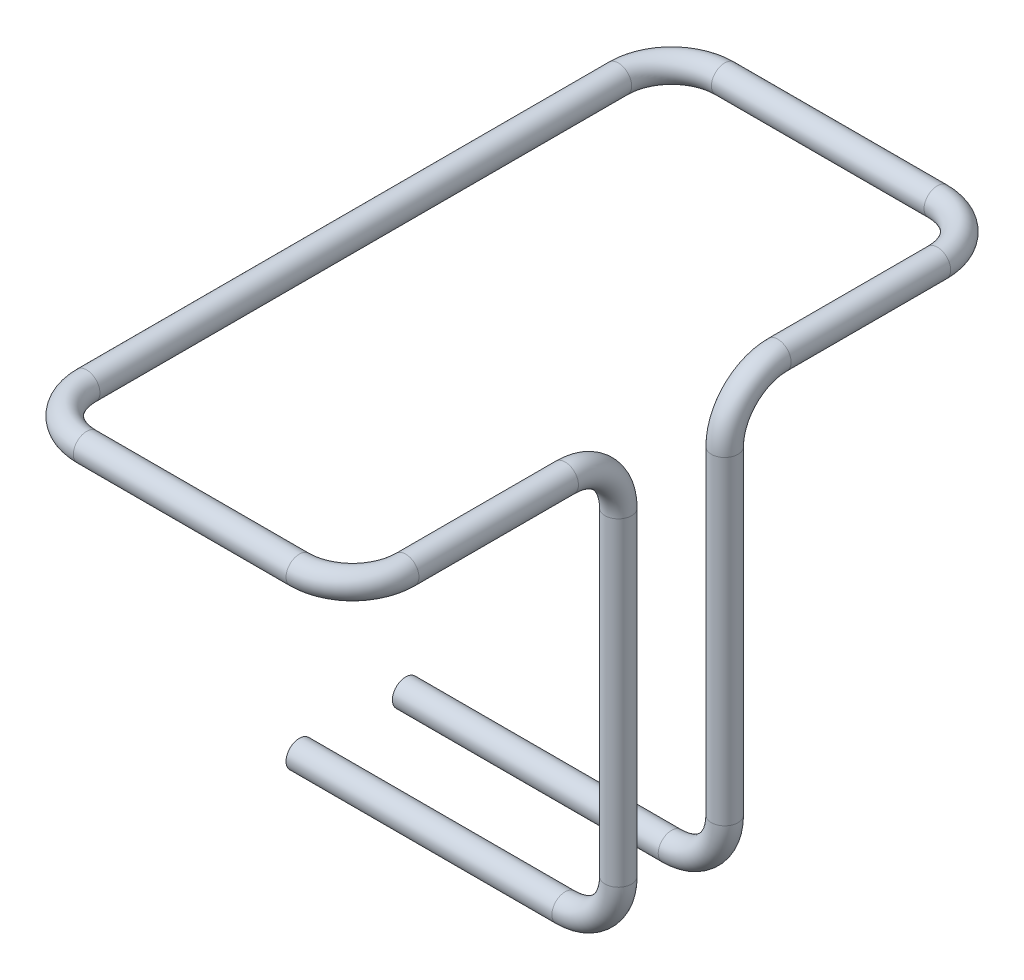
ISO-10303-21;
HEADER;
FILE_DESCRIPTION(('STEP AP214'),'2;1');
FILE_NAME('part.step','',(''),(''),'','','');
FILE_SCHEMA(('AUTOMOTIVE_DESIGN { 1 0 10303 214 1 1 1 1 }'));
ENDSEC;
DATA;
#1=APPLICATION_CONTEXT('core data for automotive mechanical design processes');
#2=APPLICATION_PROTOCOL_DEFINITION('international standard','automotive_design',2000,#1);
#3=PRODUCT_CONTEXT('',#1,'mechanical');
#4=PRODUCT('Part','Part','',(#3));
#5=PRODUCT_RELATED_PRODUCT_CATEGORY('part','',(#4));
#6=PRODUCT_DEFINITION_FORMATION('','',#4);
#7=PRODUCT_DEFINITION_CONTEXT('part definition',#1,'design');
#8=PRODUCT_DEFINITION('design','',#6,#7);
#9=PRODUCT_DEFINITION_SHAPE('','',#8);
#10=(LENGTH_UNIT() NAMED_UNIT(*) SI_UNIT(.MILLI.,.METRE.));
#11=(NAMED_UNIT(*) PLANE_ANGLE_UNIT() SI_UNIT($,.RADIAN.));
#12=(NAMED_UNIT(*) SI_UNIT($,.STERADIAN.) SOLID_ANGLE_UNIT());
#13=UNCERTAINTY_MEASURE_WITH_UNIT(LENGTH_MEASURE(1.E-05),#10,'distance_accuracy_value','');
#14=(GEOMETRIC_REPRESENTATION_CONTEXT(3) GLOBAL_UNCERTAINTY_ASSIGNED_CONTEXT((#13)) GLOBAL_UNIT_ASSIGNED_CONTEXT((#10,
#11,#12)) REPRESENTATION_CONTEXT('',''));
#15=CARTESIAN_POINT('',(0.,0.,0.));
#16=DIRECTION('',(0.,0.,1.));
#17=DIRECTION('',(1.,0.,0.));
#18=AXIS2_PLACEMENT_3D('',#15,#16,#17);
#19=CARTESIAN_POINT('',(63.5,0.,25.4));
#20=DIRECTION('',(-1.,0.,0.));
#21=DIRECTION('',(0.,-1.,0.));
#22=AXIS2_PLACEMENT_3D('',#19,#20,#21);
#23=CYLINDRICAL_SURFACE('',#22,3.175);
#24=CARTESIAN_POINT('',(63.5,0.,25.4));
#25=DIRECTION('',(-1.,0.,0.));
#26=DIRECTION('',(0.,0.,1.));
#27=AXIS2_PLACEMENT_3D('',#24,#25,#26);
#28=CIRCLE('',#27,3.175);
#29=CARTESIAN_POINT('',(63.5,-3.17499999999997,25.4));
#30=VERTEX_POINT('',#29);
#31=EDGE_CURVE('E37',#30,#30,#28,.T.);
#32=ORIENTED_EDGE('',*,*,#31,.T.);
#33=EDGE_LOOP('',(#32));
#34=FACE_BOUND('',#33,.T.);
#35=CARTESIAN_POINT('',(0.,0.,25.4));
#36=DIRECTION('',(-1.,0.,0.));
#37=DIRECTION('',(0.,0.,1.));
#38=AXIS2_PLACEMENT_3D('',#35,#36,#37);
#39=CIRCLE('',#38,3.175);
#40=CARTESIAN_POINT('',(0.,0.,28.575));
#41=VERTEX_POINT('',#40);
#42=EDGE_CURVE('E10',#41,#41,#39,.T.);
#43=ORIENTED_EDGE('',*,*,#42,.F.);
#44=EDGE_LOOP('',(#43));
#45=FACE_BOUND('',#44,.T.);
#46=ADVANCED_FACE('F31',(#34,#45),#23,.T.);
#47=CARTESIAN_POINT('',(63.5,12.7,25.4));
#48=DIRECTION('',(0.,0.,-1.));
#49=DIRECTION('',(-1.,0.,0.));
#50=AXIS2_PLACEMENT_3D('',#47,#48,#49);
#51=TOROIDAL_SURFACE('',#50,12.7,3.175);
#52=CARTESIAN_POINT('',(76.2,12.7,25.4));
#53=DIRECTION('',(0.,-1.,0.));
#54=DIRECTION('',(0.,0.,1.));
#55=AXIS2_PLACEMENT_3D('',#52,#53,#54);
#56=CIRCLE('',#55,3.175);
#57=CARTESIAN_POINT('',(79.375,12.7,25.4));
#58=VERTEX_POINT('',#57);
#59=EDGE_CURVE('E41',#58,#58,#56,.T.);
#60=CARTESIAN_POINT('',(63.5,12.7,25.4));
#61=DIRECTION('',(0.,0.,-1.));
#62=DIRECTION('',(-1.,0.,0.));
#63=AXIS2_PLACEMENT_3D('',#60,#61,#62);
#64=CIRCLE('',#63,15.875);
#65=EDGE_CURVE('',#58,#30,#64,.T.);
#66=ORIENTED_EDGE('',*,*,#59,.T.);
#67=ORIENTED_EDGE('',*,*,#31,.F.);
#68=ORIENTED_EDGE('',*,*,#65,.T.);
#69=ORIENTED_EDGE('',*,*,#65,.F.);
#70=EDGE_LOOP('',(#66,#68,#67,#69));
#71=FACE_BOUND('',#70,.T.);
#72=ADVANCED_FACE('F104',(#71),#51,.T.);
#73=CARTESIAN_POINT('',(76.2,88.9,25.4));
#74=DIRECTION('',(0.,-1.,0.));
#75=DIRECTION('',(0.,0.,-1.));
#76=AXIS2_PLACEMENT_3D('',#73,#74,#75);
#77=CYLINDRICAL_SURFACE('',#76,3.175);
#78=CARTESIAN_POINT('',(76.2,88.9,25.4));
#79=DIRECTION('',(0.,-1.,0.));
#80=DIRECTION('',(0.,0.,1.));
#81=AXIS2_PLACEMENT_3D('',#78,#79,#80);
#82=CIRCLE('',#81,3.175);
#83=CARTESIAN_POINT('',(76.2,88.9,22.225));
#84=VERTEX_POINT('',#83);
#85=EDGE_CURVE('E45',#84,#84,#82,.T.);
#86=ORIENTED_EDGE('',*,*,#85,.T.);
#87=EDGE_LOOP('',(#86));
#88=FACE_BOUND('',#87,.T.);
#89=ORIENTED_EDGE('',*,*,#59,.F.);
#90=EDGE_LOOP('',(#89));
#91=FACE_BOUND('',#90,.T.);
#92=ADVANCED_FACE('F108',(#88,#91),#77,.T.);
#93=CARTESIAN_POINT('',(76.2,88.9,38.1));
#94=DIRECTION('',(-1.,0.,0.));
#95=DIRECTION('',(0.,0.,1.));
#96=AXIS2_PLACEMENT_3D('',#93,#94,#95);
#97=TOROIDAL_SURFACE('',#96,12.7,3.175);
#98=CARTESIAN_POINT('',(76.2,101.6,38.1));
#99=DIRECTION('',(0.,0.,-1.));
#100=DIRECTION('',(0.,-1.,0.));
#101=AXIS2_PLACEMENT_3D('',#98,#99,#100);
#102=CIRCLE('',#101,3.175);
#103=CARTESIAN_POINT('',(76.2,104.775,38.1));
#104=VERTEX_POINT('',#103);
#105=EDGE_CURVE('E50',#104,#104,#102,.T.);
#106=CARTESIAN_POINT('',(76.2,88.9,38.1));
#107=DIRECTION('',(-1.,0.,0.));
#108=DIRECTION('',(0.,0.,1.));
#109=AXIS2_PLACEMENT_3D('',#106,#107,#108);
#110=CIRCLE('',#109,15.875);
#111=EDGE_CURVE('',#104,#84,#110,.T.);
#112=ORIENTED_EDGE('',*,*,#105,.T.);
#113=ORIENTED_EDGE('',*,*,#85,.F.);
#114=ORIENTED_EDGE('',*,*,#111,.T.);
#115=ORIENTED_EDGE('',*,*,#111,.F.);
#116=EDGE_LOOP('',(#112,#114,#113,#115));
#117=FACE_BOUND('',#116,.T.);
#118=ADVANCED_FACE('F114',(#117),#97,.T.);
#119=CARTESIAN_POINT('',(76.2,101.6,76.2));
#120=DIRECTION('',(0.,0.,-1.));
#121=DIRECTION('',(-1.,0.,0.));
#122=AXIS2_PLACEMENT_3D('',#119,#120,#121);
#123=CYLINDRICAL_SURFACE('',#122,3.175);
#124=CARTESIAN_POINT('',(76.2,101.6,76.2));
#125=DIRECTION('',(0.,0.,-1.));
#126=DIRECTION('',(0.,-1.,0.));
#127=AXIS2_PLACEMENT_3D('',#124,#125,#126);
#128=CIRCLE('',#127,3.175);
#129=CARTESIAN_POINT('',(79.375,101.6,76.2));
#130=VERTEX_POINT('',#129);
#131=EDGE_CURVE('E53',#130,#130,#128,.T.);
#132=ORIENTED_EDGE('',*,*,#131,.T.);
#133=EDGE_LOOP('',(#132));
#134=FACE_BOUND('',#133,.T.);
#135=ORIENTED_EDGE('',*,*,#105,.F.);
#136=EDGE_LOOP('',(#135));
#137=FACE_BOUND('',#136,.T.);
#138=ADVANCED_FACE('F121',(#134,#137),#123,.T.);
#139=CARTESIAN_POINT('',(63.5,101.6,76.2));
#140=DIRECTION('',(0.,1.,0.));
#141=DIRECTION('',(0.,0.,1.));
#142=AXIS2_PLACEMENT_3D('',#139,#140,#141);
#143=TOROIDAL_SURFACE('',#142,12.7,3.175);
#144=CARTESIAN_POINT('',(63.5,101.6,88.9));
#145=DIRECTION('',(1.,0.,0.));
#146=DIRECTION('',(0.,-1.,0.));
#147=AXIS2_PLACEMENT_3D('',#144,#145,#146);
#148=CIRCLE('',#147,3.175);
#149=CARTESIAN_POINT('',(63.5,101.6,92.075));
#150=VERTEX_POINT('',#149);
#151=EDGE_CURVE('E56',#150,#150,#148,.T.);
#152=CARTESIAN_POINT('',(63.5,101.6,76.2));
#153=DIRECTION('',(0.,1.,0.));
#154=DIRECTION('',(0.,0.,1.));
#155=AXIS2_PLACEMENT_3D('',#152,#153,#154);
#156=CIRCLE('',#155,15.875);
#157=EDGE_CURVE('',#150,#130,#156,.T.);
#158=ORIENTED_EDGE('',*,*,#151,.T.);
#159=ORIENTED_EDGE('',*,*,#131,.F.);
#160=ORIENTED_EDGE('',*,*,#157,.T.);
#161=ORIENTED_EDGE('',*,*,#157,.F.);
#162=EDGE_LOOP('',(#158,#160,#159,#161));
#163=FACE_BOUND('',#162,.T.);
#164=ADVANCED_FACE('F125',(#163),#143,.T.);
#165=CARTESIAN_POINT('',(12.7,101.6,88.9));
#166=DIRECTION('',(1.,0.,0.));
#167=DIRECTION('',(0.,0.,-1.));
#168=AXIS2_PLACEMENT_3D('',#165,#166,#167);
#169=CYLINDRICAL_SURFACE('',#168,3.175);
#170=CARTESIAN_POINT('',(12.7,101.6,88.9));
#171=DIRECTION('',(1.,0.,0.));
#172=DIRECTION('',(0.,-1.,0.));
#173=AXIS2_PLACEMENT_3D('',#170,#171,#172);
#174=CIRCLE('',#173,3.175);
#175=CARTESIAN_POINT('',(12.7,101.6,92.075));
#176=VERTEX_POINT('',#175);
#177=EDGE_CURVE('E59',#176,#176,#174,.T.);
#178=ORIENTED_EDGE('',*,*,#177,.T.);
#179=EDGE_LOOP('',(#178));
#180=FACE_BOUND('',#179,.T.);
#181=ORIENTED_EDGE('',*,*,#151,.F.);
#182=EDGE_LOOP('',(#181));
#183=FACE_BOUND('',#182,.T.);
#184=ADVANCED_FACE('F129',(#180,#183),#169,.T.);
#185=CARTESIAN_POINT('',(12.7,101.6,76.2));
#186=DIRECTION('',(0.,1.,0.));
#187=DIRECTION('',(0.,0.,1.));
#188=AXIS2_PLACEMENT_3D('',#185,#186,#187);
#189=TOROIDAL_SURFACE('',#188,12.7,3.175);
#190=CARTESIAN_POINT('',(0.,101.6,76.2));
#191=DIRECTION('',(0.,0.,1.));
#192=DIRECTION('',(0.,-1.,0.));
#193=AXIS2_PLACEMENT_3D('',#190,#191,#192);
#194=CIRCLE('',#193,3.175);
#195=CARTESIAN_POINT('',(-3.17499999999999,101.6,76.2));
#196=VERTEX_POINT('',#195);
#197=EDGE_CURVE('E62',#196,#196,#194,.T.);
#198=CARTESIAN_POINT('',(12.7,101.6,76.2));
#199=DIRECTION('',(0.,1.,0.));
#200=DIRECTION('',(0.,0.,1.));
#201=AXIS2_PLACEMENT_3D('',#198,#199,#200);
#202=CIRCLE('',#201,15.875);
#203=EDGE_CURVE('',#196,#176,#202,.T.);
#204=ORIENTED_EDGE('',*,*,#197,.T.);
#205=ORIENTED_EDGE('',*,*,#177,.F.);
#206=ORIENTED_EDGE('',*,*,#203,.T.);
#207=ORIENTED_EDGE('',*,*,#203,.F.);
#208=EDGE_LOOP('',(#204,#206,#205,#207));
#209=FACE_BOUND('',#208,.T.);
#210=ADVANCED_FACE('F133',(#209),#189,.T.);
#211=CARTESIAN_POINT('',(0.,101.6,-50.8));
#212=DIRECTION('',(0.,0.,1.));
#213=DIRECTION('',(1.,0.,0.));
#214=AXIS2_PLACEMENT_3D('',#211,#212,#213);
#215=CYLINDRICAL_SURFACE('',#214,3.175);
#216=CARTESIAN_POINT('',(0.,101.6,-50.8));
#217=DIRECTION('',(0.,0.,1.));
#218=DIRECTION('',(0.,-1.,0.));
#219=AXIS2_PLACEMENT_3D('',#216,#217,#218);
#220=CIRCLE('',#219,3.175);
#221=CARTESIAN_POINT('',(-3.17499999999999,101.6,-50.8));
#222=VERTEX_POINT('',#221);
#223=EDGE_CURVE('E65',#222,#222,#220,.T.);
#224=ORIENTED_EDGE('',*,*,#223,.T.);
#225=EDGE_LOOP('',(#224));
#226=FACE_BOUND('',#225,.T.);
#227=ORIENTED_EDGE('',*,*,#197,.F.);
#228=EDGE_LOOP('',(#227));
#229=FACE_BOUND('',#228,.T.);
#230=ADVANCED_FACE('F137',(#226,#229),#215,.T.);
#231=CARTESIAN_POINT('',(12.7,101.6,-50.8));
#232=DIRECTION('',(0.,1.,0.));
#233=DIRECTION('',(0.,0.,1.));
#234=AXIS2_PLACEMENT_3D('',#231,#232,#233);
#235=TOROIDAL_SURFACE('',#234,12.7,3.175);
#236=CARTESIAN_POINT('',(12.7,101.6,-63.5));
#237=DIRECTION('',(-1.,0.,0.));
#238=DIRECTION('',(0.,-1.,0.));
#239=AXIS2_PLACEMENT_3D('',#236,#237,#238);
#240=CIRCLE('',#239,3.175);
#241=CARTESIAN_POINT('',(12.7,101.6,-66.675));
#242=VERTEX_POINT('',#241);
#243=EDGE_CURVE('E68',#242,#242,#240,.T.);
#244=CARTESIAN_POINT('',(12.7,101.6,-50.8));
#245=DIRECTION('',(0.,1.,0.));
#246=DIRECTION('',(0.,0.,1.));
#247=AXIS2_PLACEMENT_3D('',#244,#245,#246);
#248=CIRCLE('',#247,15.875);
#249=EDGE_CURVE('',#242,#222,#248,.T.);
#250=ORIENTED_EDGE('',*,*,#243,.T.);
#251=ORIENTED_EDGE('',*,*,#223,.F.);
#252=ORIENTED_EDGE('',*,*,#249,.T.);
#253=ORIENTED_EDGE('',*,*,#249,.F.);
#254=EDGE_LOOP('',(#250,#252,#251,#253));
#255=FACE_BOUND('',#254,.T.);
#256=ADVANCED_FACE('F141',(#255),#235,.T.);
#257=CARTESIAN_POINT('',(63.5,101.6,-63.5));
#258=DIRECTION('',(-1.,0.,0.));
#259=DIRECTION('',(0.,0.,1.));
#260=AXIS2_PLACEMENT_3D('',#257,#258,#259);
#261=CYLINDRICAL_SURFACE('',#260,3.175);
#262=CARTESIAN_POINT('',(63.5,101.6,-63.5));
#263=DIRECTION('',(-1.,0.,0.));
#264=DIRECTION('',(0.,-1.,0.));
#265=AXIS2_PLACEMENT_3D('',#262,#263,#264);
#266=CIRCLE('',#265,3.175);
#267=CARTESIAN_POINT('',(63.5,101.6,-66.675));
#268=VERTEX_POINT('',#267);
#269=EDGE_CURVE('E71',#268,#268,#266,.T.);
#270=ORIENTED_EDGE('',*,*,#269,.T.);
#271=EDGE_LOOP('',(#270));
#272=FACE_BOUND('',#271,.T.);
#273=ORIENTED_EDGE('',*,*,#243,.F.);
#274=EDGE_LOOP('',(#273));
#275=FACE_BOUND('',#274,.T.);
#276=ADVANCED_FACE('F145',(#272,#275),#261,.T.);
#277=CARTESIAN_POINT('',(63.5,101.6,-50.8));
#278=DIRECTION('',(0.,1.,0.));
#279=DIRECTION('',(0.,0.,1.));
#280=AXIS2_PLACEMENT_3D('',#277,#278,#279);
#281=TOROIDAL_SURFACE('',#280,12.7,3.175);
#282=CARTESIAN_POINT('',(76.2,101.6,-50.8));
#283=DIRECTION('',(0.,0.,-1.));
#284=DIRECTION('',(0.,-1.,0.));
#285=AXIS2_PLACEMENT_3D('',#282,#283,#284);
#286=CIRCLE('',#285,3.175);
#287=CARTESIAN_POINT('',(79.375,101.6,-50.8));
#288=VERTEX_POINT('',#287);
#289=EDGE_CURVE('E74',#288,#288,#286,.T.);
#290=CARTESIAN_POINT('',(63.5,101.6,-50.8));
#291=DIRECTION('',(0.,1.,0.));
#292=DIRECTION('',(0.,0.,1.));
#293=AXIS2_PLACEMENT_3D('',#290,#291,#292);
#294=CIRCLE('',#293,15.875);
#295=EDGE_CURVE('',#288,#268,#294,.T.);
#296=ORIENTED_EDGE('',*,*,#289,.T.);
#297=ORIENTED_EDGE('',*,*,#269,.F.);
#298=ORIENTED_EDGE('',*,*,#295,.T.);
#299=ORIENTED_EDGE('',*,*,#295,.F.);
#300=EDGE_LOOP('',(#296,#298,#297,#299));
#301=FACE_BOUND('',#300,.T.);
#302=ADVANCED_FACE('F149',(#301),#281,.T.);
#303=CARTESIAN_POINT('',(76.2,101.6,-12.7));
#304=DIRECTION('',(0.,0.,-1.));
#305=DIRECTION('',(-1.,0.,0.));
#306=AXIS2_PLACEMENT_3D('',#303,#304,#305);
#307=CYLINDRICAL_SURFACE('',#306,3.175);
#308=CARTESIAN_POINT('',(76.2,101.6,-12.7));
#309=DIRECTION('',(0.,0.,-1.));
#310=DIRECTION('',(0.,-1.,0.));
#311=AXIS2_PLACEMENT_3D('',#308,#309,#310);
#312=CIRCLE('',#311,3.175);
#313=CARTESIAN_POINT('',(76.2,104.775,-12.7));
#314=VERTEX_POINT('',#313);
#315=EDGE_CURVE('E77',#314,#314,#312,.T.);
#316=ORIENTED_EDGE('',*,*,#315,.T.);
#317=EDGE_LOOP('',(#316));
#318=FACE_BOUND('',#317,.T.);
#319=ORIENTED_EDGE('',*,*,#289,.F.);
#320=EDGE_LOOP('',(#319));
#321=FACE_BOUND('',#320,.T.);
#322=ADVANCED_FACE('F153',(#318,#321),#307,.T.);
#323=CARTESIAN_POINT('',(76.2,88.9,-12.7));
#324=DIRECTION('',(-1.,0.,0.));
#325=DIRECTION('',(0.,0.,1.));
#326=AXIS2_PLACEMENT_3D('',#323,#324,#325);
#327=TOROIDAL_SURFACE('',#326,12.7,3.175);
#328=CARTESIAN_POINT('',(76.2,88.9,0.));
#329=DIRECTION('',(0.,1.,0.));
#330=DIRECTION('',(0.,0.,-1.));
#331=AXIS2_PLACEMENT_3D('',#328,#329,#330);
#332=CIRCLE('',#331,3.175);
#333=CARTESIAN_POINT('',(76.2,88.9,3.175));
#334=VERTEX_POINT('',#333);
#335=EDGE_CURVE('E80',#334,#334,#332,.T.);
#336=CARTESIAN_POINT('',(76.2,88.9,-12.7));
#337=DIRECTION('',(-1.,0.,0.));
#338=DIRECTION('',(0.,0.,1.));
#339=AXIS2_PLACEMENT_3D('',#336,#337,#338);
#340=CIRCLE('',#339,15.875);
#341=EDGE_CURVE('',#334,#314,#340,.T.);
#342=ORIENTED_EDGE('',*,*,#335,.T.);
#343=ORIENTED_EDGE('',*,*,#315,.F.);
#344=ORIENTED_EDGE('',*,*,#341,.T.);
#345=ORIENTED_EDGE('',*,*,#341,.F.);
#346=EDGE_LOOP('',(#342,#344,#343,#345));
#347=FACE_BOUND('',#346,.T.);
#348=ADVANCED_FACE('F157',(#347),#327,.T.);
#349=CARTESIAN_POINT('',(76.2,12.7,0.));
#350=DIRECTION('',(0.,1.,0.));
#351=DIRECTION('',(0.,0.,1.));
#352=AXIS2_PLACEMENT_3D('',#349,#350,#351);
#353=CYLINDRICAL_SURFACE('',#352,3.175);
#354=CARTESIAN_POINT('',(76.2,12.7,0.));
#355=DIRECTION('',(0.,1.,0.));
#356=DIRECTION('',(0.,0.,-1.));
#357=AXIS2_PLACEMENT_3D('',#354,#355,#356);
#358=CIRCLE('',#357,3.175);
#359=CARTESIAN_POINT('',(79.375,12.7,0.));
#360=VERTEX_POINT('',#359);
#361=EDGE_CURVE('E83',#360,#360,#358,.T.);
#362=ORIENTED_EDGE('',*,*,#361,.T.);
#363=EDGE_LOOP('',(#362));
#364=FACE_BOUND('',#363,.T.);
#365=ORIENTED_EDGE('',*,*,#335,.F.);
#366=EDGE_LOOP('',(#365));
#367=FACE_BOUND('',#366,.T.);
#368=ADVANCED_FACE('F161',(#364,#367),#353,.T.);
#369=CARTESIAN_POINT('',(63.5,12.7,0.));
#370=DIRECTION('',(0.,0.,1.));
#371=DIRECTION('',(1.,0.,0.));
#372=AXIS2_PLACEMENT_3D('',#369,#370,#371);
#373=TOROIDAL_SURFACE('',#372,12.7,3.175);
#374=CARTESIAN_POINT('',(63.5,0.,0.));
#375=DIRECTION('',(1.,0.,0.));
#376=DIRECTION('',(0.,0.,-1.));
#377=AXIS2_PLACEMENT_3D('',#374,#375,#376);
#378=CIRCLE('',#377,3.175);
#379=CARTESIAN_POINT('',(63.5,-3.175,0.));
#380=VERTEX_POINT('',#379);
#381=EDGE_CURVE('E86',#380,#380,#378,.T.);
#382=CARTESIAN_POINT('',(63.5,12.7,0.));
#383=DIRECTION('',(0.,0.,1.));
#384=DIRECTION('',(1.,0.,0.));
#385=AXIS2_PLACEMENT_3D('',#382,#383,#384);
#386=CIRCLE('',#385,15.875);
#387=EDGE_CURVE('',#380,#360,#386,.T.);
#388=ORIENTED_EDGE('',*,*,#381,.T.);
#389=ORIENTED_EDGE('',*,*,#361,.F.);
#390=ORIENTED_EDGE('',*,*,#387,.T.);
#391=ORIENTED_EDGE('',*,*,#387,.F.);
#392=EDGE_LOOP('',(#388,#390,#389,#391));
#393=FACE_BOUND('',#392,.T.);
#394=ADVANCED_FACE('F165',(#393),#373,.T.);
#395=CARTESIAN_POINT('',(63.5,0.,0.));
#396=DIRECTION('',(-1.,0.,0.));
#397=DIRECTION('',(0.,0.,1.));
#398=AXIS2_PLACEMENT_3D('',#395,#396,#397);
#399=CYLINDRICAL_SURFACE('',#398,3.175);
#400=ORIENTED_EDGE('',*,*,#381,.F.);
#401=EDGE_LOOP('',(#400));
#402=FACE_BOUND('',#401,.T.);
#403=CARTESIAN_POINT('',(0.,0.,0.));
#404=DIRECTION('',(1.,0.,0.));
#405=DIRECTION('',(0.,0.,-1.));
#406=AXIS2_PLACEMENT_3D('',#403,#404,#405);
#407=CIRCLE('',#406,3.175);
#408=CARTESIAN_POINT('',(0.,0.,-3.175));
#409=VERTEX_POINT('',#408);
#410=EDGE_CURVE('E89',#409,#409,#407,.T.);
#411=ORIENTED_EDGE('',*,*,#410,.T.);
#412=EDGE_LOOP('',(#411));
#413=FACE_BOUND('',#412,.T.);
#414=ADVANCED_FACE('F93',(#402,#413),#399,.T.);
#415=CARTESIAN_POINT('',(0.,0.,25.4));
#416=DIRECTION('',(-1.,0.,0.));
#417=DIRECTION('',(0.,0.,1.));
#418=AXIS2_PLACEMENT_3D('',#415,#416,#417);
#419=PLANE('',#418);
#420=ORIENTED_EDGE('',*,*,#42,.T.);
#421=EDGE_LOOP('',(#420));
#422=FACE_BOUND('',#421,.T.);
#423=ADVANCED_FACE('F97',(#422),#419,.T.);
#424=CARTESIAN_POINT('',(0.,0.,0.));
#425=DIRECTION('',(1.,0.,0.));
#426=DIRECTION('',(0.,0.,-1.));
#427=AXIS2_PLACEMENT_3D('',#424,#425,#426);
#428=PLANE('',#427);
#429=ORIENTED_EDGE('',*,*,#410,.F.);
#430=EDGE_LOOP('',(#429));
#431=FACE_BOUND('',#430,.T.);
#432=ADVANCED_FACE('F95',(#431),#428,.F.);
#433=CLOSED_SHELL('',(#46,#72,#92,#118,#138,#164,#184,#210,#230,#256,#276,#302,#322,#348,#368,
#394,#414,#423,#432));
#434=MANIFOLD_SOLID_BREP('B2',#433);
#435=ADVANCED_BREP_SHAPE_REPRESENTATION('',(#18,#434),#14);
#436=SHAPE_DEFINITION_REPRESENTATION(#9,#435);
ENDSEC;
END-ISO-10303-21;
